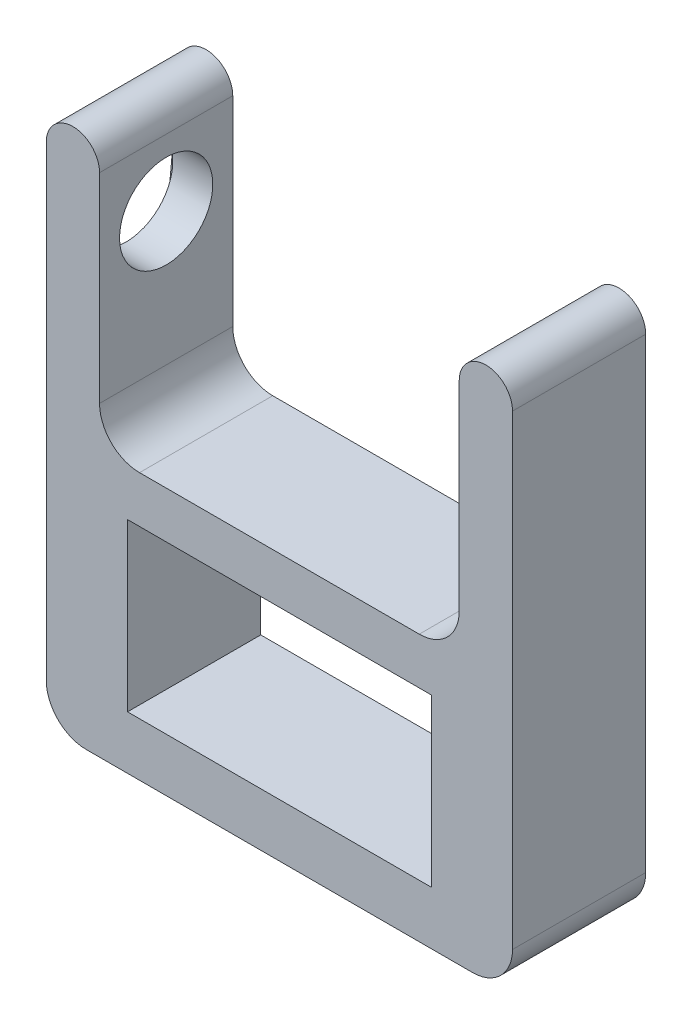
ISO-10303-21;
HEADER;
FILE_DESCRIPTION(('STEP AP214'),'2;1');
FILE_NAME('part.step','',(''),(''),'','','');
FILE_SCHEMA(('AUTOMOTIVE_DESIGN { 1 0 10303 214 1 1 1 1 }'));
ENDSEC;
DATA;
#1=APPLICATION_CONTEXT('core data for automotive mechanical design processes');
#2=APPLICATION_PROTOCOL_DEFINITION('international standard','automotive_design',2000,#1);
#3=PRODUCT_CONTEXT('',#1,'mechanical');
#4=PRODUCT('Part','Part','',(#3));
#5=PRODUCT_RELATED_PRODUCT_CATEGORY('part','',(#4));
#6=PRODUCT_DEFINITION_FORMATION('','',#4);
#7=PRODUCT_DEFINITION_CONTEXT('part definition',#1,'design');
#8=PRODUCT_DEFINITION('design','',#6,#7);
#9=PRODUCT_DEFINITION_SHAPE('','',#8);
#10=(LENGTH_UNIT() NAMED_UNIT(*) SI_UNIT(.MILLI.,.METRE.));
#11=(NAMED_UNIT(*) PLANE_ANGLE_UNIT() SI_UNIT($,.RADIAN.));
#12=(NAMED_UNIT(*) SI_UNIT($,.STERADIAN.) SOLID_ANGLE_UNIT());
#13=UNCERTAINTY_MEASURE_WITH_UNIT(LENGTH_MEASURE(1.E-05),#10,'distance_accuracy_value','');
#14=(GEOMETRIC_REPRESENTATION_CONTEXT(3) GLOBAL_UNCERTAINTY_ASSIGNED_CONTEXT((#13)) GLOBAL_UNIT_ASSIGNED_CONTEXT((#10,
#11,#12)) REPRESENTATION_CONTEXT('',''));
#15=CARTESIAN_POINT('',(0.,0.,0.));
#16=DIRECTION('',(0.,0.,1.));
#17=DIRECTION('',(1.,0.,0.));
#18=AXIS2_PLACEMENT_3D('',#15,#16,#17);
#19=CARTESIAN_POINT('',(17.501,13.,5.));
#20=DIRECTION('',(-1.,0.,0.));
#21=DIRECTION('',(0.,0.,1.));
#22=AXIS2_PLACEMENT_3D('',#19,#20,#21);
#23=CYLINDRICAL_SURFACE('',#22,3.5);
#24=CARTESIAN_POINT('',(-13.5,13.,5.));
#25=DIRECTION('',(-1.,0.,0.));
#26=DIRECTION('',(0.,0.,1.));
#27=AXIS2_PLACEMENT_3D('',#24,#25,#26);
#28=CIRCLE('',#27,3.5);
#29=CARTESIAN_POINT('',(-13.5,13.,8.5));
#30=VERTEX_POINT('',#29);
#31=EDGE_CURVE('E216',#30,#30,#28,.F.);
#32=ORIENTED_EDGE('',*,*,#31,.T.);
#33=EDGE_LOOP('',(#32));
#34=FACE_BOUND('',#33,.T.);
#35=CARTESIAN_POINT('',(-16.5,13.,5.));
#36=DIRECTION('',(-1.,0.,0.));
#37=DIRECTION('',(0.,0.,1.));
#38=AXIS2_PLACEMENT_3D('',#35,#36,#37);
#39=CIRCLE('',#38,3.5);
#40=CARTESIAN_POINT('',(-16.5,13.,8.5));
#41=VERTEX_POINT('',#40);
#42=EDGE_CURVE('E44',#41,#41,#39,.F.);
#43=ORIENTED_EDGE('',*,*,#42,.F.);
#44=EDGE_LOOP('',(#43));
#45=FACE_BOUND('',#44,.T.);
#46=ADVANCED_FACE('F40',(#34,#45),#23,.F.);
#47=CARTESIAN_POINT('',(15.5,18.,0.));
#48=DIRECTION('',(0.,0.,-1.));
#49=DIRECTION('',(-1.,0.,0.));
#50=AXIS2_PLACEMENT_3D('',#47,#48,#49);
#51=CYLINDRICAL_SURFACE('',#50,2.);
#52=DIRECTION('',(0.,0.,-1.));
#53=VECTOR('',#52,1.);
#54=CARTESIAN_POINT('',(17.5,18.,10.));
#55=LINE('',#54,#53);
#56=CARTESIAN_POINT('',(17.5,18.,0.));
#57=VERTEX_POINT('',#56);
#58=CARTESIAN_POINT('',(17.5,18.,10.));
#59=VERTEX_POINT('',#58);
#60=EDGE_CURVE('E312',#57,#59,#55,.F.);
#61=ORIENTED_EDGE('',*,*,#60,.F.);
#62=CARTESIAN_POINT('',(15.5,18.,0.));
#63=DIRECTION('',(0.,0.,-1.));
#64=DIRECTION('',(-1.,0.,0.));
#65=AXIS2_PLACEMENT_3D('',#62,#63,#64);
#66=CIRCLE('',#65,2.);
#67=CARTESIAN_POINT('',(13.5,18.,0.));
#68=VERTEX_POINT('',#67);
#69=EDGE_CURVE('E318',#68,#57,#66,.T.);
#70=ORIENTED_EDGE('',*,*,#69,.F.);
#71=DIRECTION('',(0.,0.,-1.));
#72=VECTOR('',#71,1.);
#73=CARTESIAN_POINT('',(13.5,18.,0.));
#74=LINE('',#73,#72);
#75=CARTESIAN_POINT('',(13.5,18.,10.));
#76=VERTEX_POINT('',#75);
#77=EDGE_CURVE('E315',#76,#68,#74,.T.);
#78=ORIENTED_EDGE('',*,*,#77,.F.);
#79=CARTESIAN_POINT('',(15.5,18.,10.));
#80=DIRECTION('',(0.,0.,-1.));
#81=DIRECTION('',(-1.,0.,0.));
#82=AXIS2_PLACEMENT_3D('',#79,#80,#81);
#83=CIRCLE('',#82,2.);
#84=EDGE_CURVE('E320',#59,#76,#83,.F.);
#85=ORIENTED_EDGE('',*,*,#84,.F.);
#86=EDGE_LOOP('',(#61,#70,#78,#85));
#87=FACE_BOUND('',#86,.T.);
#88=ADVANCED_FACE('F389',(#87),#51,.T.);
#89=CARTESIAN_POINT('',(-15.5,18.,10.));
#90=DIRECTION('',(0.,0.,-1.));
#91=DIRECTION('',(-1.,0.,0.));
#92=AXIS2_PLACEMENT_3D('',#89,#90,#91);
#93=CYLINDRICAL_SURFACE('',#92,2.);
#94=DIRECTION('',(0.,0.,-1.));
#95=VECTOR('',#94,1.);
#96=CARTESIAN_POINT('',(-17.5,18.,10.));
#97=LINE('',#96,#95);
#98=CARTESIAN_POINT('',(-17.5,18.,10.));
#99=VERTEX_POINT('',#98);
#100=CARTESIAN_POINT('',(-17.5,18.,0.));
#101=VERTEX_POINT('',#100);
#102=EDGE_CURVE('E302',#99,#101,#97,.T.);
#103=ORIENTED_EDGE('',*,*,#102,.F.);
#104=CARTESIAN_POINT('',(-15.5,18.,10.));
#105=DIRECTION('',(0.,0.,-1.));
#106=DIRECTION('',(-1.,0.,0.));
#107=AXIS2_PLACEMENT_3D('',#104,#105,#106);
#108=CIRCLE('',#107,2.);
#109=CARTESIAN_POINT('',(-13.5,18.,10.));
#110=VERTEX_POINT('',#109);
#111=EDGE_CURVE('E308',#110,#99,#108,.F.);
#112=ORIENTED_EDGE('',*,*,#111,.F.);
#113=DIRECTION('',(0.,0.,-1.));
#114=VECTOR('',#113,1.);
#115=CARTESIAN_POINT('',(-13.5,18.,0.));
#116=LINE('',#115,#114);
#117=CARTESIAN_POINT('',(-13.5,18.,0.));
#118=VERTEX_POINT('',#117);
#119=EDGE_CURVE('E305',#118,#110,#116,.F.);
#120=ORIENTED_EDGE('',*,*,#119,.F.);
#121=CARTESIAN_POINT('',(-15.5,18.,0.));
#122=DIRECTION('',(0.,0.,-1.));
#123=DIRECTION('',(-1.,0.,0.));
#124=AXIS2_PLACEMENT_3D('',#121,#122,#123);
#125=CIRCLE('',#124,2.);
#126=EDGE_CURVE('E310',#101,#118,#125,.T.);
#127=ORIENTED_EDGE('',*,*,#126,.F.);
#128=EDGE_LOOP('',(#103,#112,#120,#127));
#129=FACE_BOUND('',#128,.T.);
#130=ADVANCED_FACE('F365',(#129),#93,.T.);
#131=CARTESIAN_POINT('',(17.5,-20.,10.));
#132=DIRECTION('',(-1.,0.,0.));
#133=DIRECTION('',(0.,0.,1.));
#134=AXIS2_PLACEMENT_3D('',#131,#132,#133);
#135=PLANE('',#134);
#136=DIRECTION('',(0.,1.,0.));
#137=VECTOR('',#136,1.);
#138=CARTESIAN_POINT('',(17.5,-20.,0.));
#139=LINE('',#138,#137);
#140=CARTESIAN_POINT('',(17.5,-17.,0.));
#141=VERTEX_POINT('',#140);
#142=EDGE_CURVE('E261',#141,#57,#139,.T.);
#143=ORIENTED_EDGE('',*,*,#142,.T.);
#144=ORIENTED_EDGE('',*,*,#60,.T.);
#145=DIRECTION('',(0.,1.,0.));
#146=VECTOR('',#145,1.);
#147=CARTESIAN_POINT('',(17.5,-20.,10.));
#148=LINE('',#147,#146);
#149=CARTESIAN_POINT('',(17.5,-17.,10.));
#150=VERTEX_POINT('',#149);
#151=EDGE_CURVE('E267',#150,#59,#148,.T.);
#152=ORIENTED_EDGE('',*,*,#151,.F.);
#153=DIRECTION('',(0.,0.,-1.));
#154=VECTOR('',#153,1.);
#155=CARTESIAN_POINT('',(17.5,-17.,10.));
#156=LINE('',#155,#154);
#157=EDGE_CURVE('E276',#150,#141,#156,.T.);
#158=ORIENTED_EDGE('',*,*,#157,.T.);
#159=EDGE_LOOP('',(#143,#144,#152,#158));
#160=FACE_BOUND('',#159,.T.);
#161=ADVANCED_FACE('F385',(#160),#135,.F.);
#162=CARTESIAN_POINT('',(-17.5,-20.,10.));
#163=DIRECTION('',(1.,0.,0.));
#164=DIRECTION('',(0.,0.,-1.));
#165=AXIS2_PLACEMENT_3D('',#162,#163,#164);
#166=PLANE('',#165);
#167=DIRECTION('',(0.,-0.995037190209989,0.0995037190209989));
#168=VECTOR('',#167,1.);
#169=CARTESIAN_POINT('',(-17.5,13.,0.5));
#170=LINE('',#169,#168);
#171=CARTESIAN_POINT('',(-17.5,13.,0.499999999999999));
#172=VERTEX_POINT('',#171);
#173=CARTESIAN_POINT('',(-17.5,-2.,2.));
#174=VERTEX_POINT('',#173);
#175=EDGE_CURVE('E207',#172,#174,#170,.T.);
#176=ORIENTED_EDGE('',*,*,#175,.F.);
#177=CARTESIAN_POINT('',(-17.5,13.,5.));
#178=DIRECTION('',(-1.,0.,0.));
#179=DIRECTION('',(0.,0.,1.));
#180=AXIS2_PLACEMENT_3D('',#177,#178,#179);
#181=CIRCLE('',#180,4.5);
#182=CARTESIAN_POINT('',(-17.5,13.,9.5));
#183=VERTEX_POINT('',#182);
#184=EDGE_CURVE('E56',#183,#172,#181,.T.);
#185=ORIENTED_EDGE('',*,*,#184,.F.);
#186=DIRECTION('',(0.,0.995037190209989,0.099503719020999));
#187=VECTOR('',#186,1.);
#188=CARTESIAN_POINT('',(-17.5,13.,9.5));
#189=LINE('',#188,#187);
#190=CARTESIAN_POINT('',(-17.5,-2.,8.));
#191=VERTEX_POINT('',#190);
#192=EDGE_CURVE('E198',#191,#183,#189,.T.);
#193=ORIENTED_EDGE('',*,*,#192,.F.);
#194=CARTESIAN_POINT('',(-17.5,-2.,5.));
#195=DIRECTION('',(-1.,0.,0.));
#196=DIRECTION('',(0.,0.,1.));
#197=AXIS2_PLACEMENT_3D('',#194,#195,#196);
#198=CIRCLE('',#197,3.);
#199=EDGE_CURVE('E201',#174,#191,#198,.T.);
#200=ORIENTED_EDGE('',*,*,#199,.F.);
#201=EDGE_LOOP('',(#176,#185,#193,#200));
#202=FACE_BOUND('',#201,.T.);
#203=DIRECTION('',(0.,-1.,0.));
#204=VECTOR('',#203,1.);
#205=CARTESIAN_POINT('',(-17.5,-20.,10.));
#206=LINE('',#205,#204);
#207=CARTESIAN_POINT('',(-17.5,-17.,10.));
#208=VERTEX_POINT('',#207);
#209=EDGE_CURVE('E270',#99,#208,#206,.T.);
#210=ORIENTED_EDGE('',*,*,#209,.F.);
#211=ORIENTED_EDGE('',*,*,#102,.T.);
#212=DIRECTION('',(0.,-1.,0.));
#213=VECTOR('',#212,1.);
#214=CARTESIAN_POINT('',(-17.5,-20.,0.));
#215=LINE('',#214,#213);
#216=CARTESIAN_POINT('',(-17.5,-17.,0.));
#217=VERTEX_POINT('',#216);
#218=EDGE_CURVE('E279',#101,#217,#215,.T.);
#219=ORIENTED_EDGE('',*,*,#218,.T.);
#220=DIRECTION('',(0.,0.,-1.));
#221=VECTOR('',#220,1.);
#222=CARTESIAN_POINT('',(-17.5,-17.,10.));
#223=LINE('',#222,#221);
#224=EDGE_CURVE('E299',#217,#208,#223,.F.);
#225=ORIENTED_EDGE('',*,*,#224,.T.);
#226=EDGE_LOOP('',(#210,#211,#219,#225));
#227=FACE_BOUND('',#226,.T.);
#228=ADVANCED_FACE('F368',(#202,#227),#166,.F.);
#229=CARTESIAN_POINT('',(-17.5,-20.,10.));
#230=DIRECTION('',(0.,1.,0.));
#231=DIRECTION('',(0.,0.,1.));
#232=AXIS2_PLACEMENT_3D('',#229,#230,#231);
#233=PLANE('',#232);
#234=DIRECTION('',(1.,0.,0.));
#235=VECTOR('',#234,1.);
#236=CARTESIAN_POINT('',(-17.5,-20.,0.));
#237=LINE('',#236,#235);
#238=CARTESIAN_POINT('',(-14.5,-20.,0.));
#239=VERTEX_POINT('',#238);
#240=CARTESIAN_POINT('',(14.5,-20.,0.));
#241=VERTEX_POINT('',#240);
#242=EDGE_CURVE('E271',#239,#241,#237,.T.);
#243=ORIENTED_EDGE('',*,*,#242,.T.);
#244=DIRECTION('',(0.,0.,-1.));
#245=VECTOR('',#244,1.);
#246=CARTESIAN_POINT('',(14.5,-20.,10.));
#247=LINE('',#246,#245);
#248=CARTESIAN_POINT('',(14.5,-20.,10.));
#249=VERTEX_POINT('',#248);
#250=EDGE_CURVE('E293',#241,#249,#247,.F.);
#251=ORIENTED_EDGE('',*,*,#250,.T.);
#252=DIRECTION('',(1.,0.,0.));
#253=VECTOR('',#252,1.);
#254=CARTESIAN_POINT('',(-17.5,-20.,10.));
#255=LINE('',#254,#253);
#256=CARTESIAN_POINT('',(-14.5,-20.,10.));
#257=VERTEX_POINT('',#256);
#258=EDGE_CURVE('E273',#257,#249,#255,.T.);
#259=ORIENTED_EDGE('',*,*,#258,.F.);
#260=DIRECTION('',(0.,0.,-1.));
#261=VECTOR('',#260,1.);
#262=CARTESIAN_POINT('',(-14.5,-20.,10.));
#263=LINE('',#262,#261);
#264=EDGE_CURVE('E290',#257,#239,#263,.T.);
#265=ORIENTED_EDGE('',*,*,#264,.T.);
#266=EDGE_LOOP('',(#243,#251,#259,#265));
#267=FACE_BOUND('',#266,.T.);
#268=ADVANCED_FACE('F377',(#267),#233,.F.);
#269=CARTESIAN_POINT('',(0.,0.,10.));
#270=DIRECTION('',(0.,0.,-1.));
#271=DIRECTION('',(-1.,0.,0.));
#272=AXIS2_PLACEMENT_3D('',#269,#270,#271);
#273=PLANE('',#272);
#274=DIRECTION('',(1.,0.,0.));
#275=VECTOR('',#274,1.);
#276=CARTESIAN_POINT('',(-11.4,-16.,10.));
#277=LINE('',#276,#275);
#278=CARTESIAN_POINT('',(-11.4,-16.,10.));
#279=VERTEX_POINT('',#278);
#280=CARTESIAN_POINT('',(11.4,-16.,10.));
#281=VERTEX_POINT('',#280);
#282=EDGE_CURVE('E235',#279,#281,#277,.T.);
#283=ORIENTED_EDGE('',*,*,#282,.F.);
#284=DIRECTION('',(0.,-1.,0.));
#285=VECTOR('',#284,1.);
#286=CARTESIAN_POINT('',(-11.4,-16.,10.));
#287=LINE('',#286,#285);
#288=CARTESIAN_POINT('',(-11.4,-3.5,10.));
#289=VERTEX_POINT('',#288);
#290=EDGE_CURVE('E219',#289,#279,#287,.T.);
#291=ORIENTED_EDGE('',*,*,#290,.F.);
#292=DIRECTION('',(-1.,0.,0.));
#293=VECTOR('',#292,1.);
#294=CARTESIAN_POINT('',(-11.4,-3.5,10.));
#295=LINE('',#294,#293);
#296=CARTESIAN_POINT('',(11.4,-3.5,10.));
#297=VERTEX_POINT('',#296);
#298=EDGE_CURVE('E224',#297,#289,#295,.T.);
#299=ORIENTED_EDGE('',*,*,#298,.F.);
#300=DIRECTION('',(0.,1.,0.));
#301=VECTOR('',#300,1.);
#302=CARTESIAN_POINT('',(11.4,-16.,10.));
#303=LINE('',#302,#301);
#304=EDGE_CURVE('E238',#281,#297,#303,.T.);
#305=ORIENTED_EDGE('',*,*,#304,.F.);
#306=EDGE_LOOP('',(#283,#291,#299,#305));
#307=FACE_BOUND('',#306,.T.);
#308=ORIENTED_EDGE('',*,*,#151,.T.);
#309=ORIENTED_EDGE('',*,*,#84,.T.);
#310=DIRECTION('',(0.,1.,0.));
#311=VECTOR('',#310,1.);
#312=CARTESIAN_POINT('',(13.5,20.,10.));
#313=LINE('',#312,#311);
#314=CARTESIAN_POINT('',(13.5,3.,10.));
#315=VERTEX_POINT('',#314);
#316=EDGE_CURVE('E256',#315,#76,#313,.T.);
#317=ORIENTED_EDGE('',*,*,#316,.F.);
#318=CARTESIAN_POINT('',(10.5,3.,10.));
#319=DIRECTION('',(0.,0.,-1.));
#320=DIRECTION('',(-1.,0.,0.));
#321=AXIS2_PLACEMENT_3D('',#318,#319,#320);
#322=CIRCLE('',#321,3.);
#323=CARTESIAN_POINT('',(10.5,0.,10.));
#324=VERTEX_POINT('',#323);
#325=EDGE_CURVE('E333',#315,#324,#322,.T.);
#326=ORIENTED_EDGE('',*,*,#325,.T.);
#327=DIRECTION('',(1.,0.,0.));
#328=VECTOR('',#327,1.);
#329=CARTESIAN_POINT('',(-13.5,0.,10.));
#330=LINE('',#329,#328);
#331=CARTESIAN_POINT('',(-10.5,0.,10.));
#332=VERTEX_POINT('',#331);
#333=EDGE_CURVE('E263',#332,#324,#330,.T.);
#334=ORIENTED_EDGE('',*,*,#333,.F.);
#335=CARTESIAN_POINT('',(-10.5,3.,10.));
#336=DIRECTION('',(0.,0.,-1.));
#337=DIRECTION('',(-1.,0.,0.));
#338=AXIS2_PLACEMENT_3D('',#335,#336,#337);
#339=CIRCLE('',#338,3.);
#340=CARTESIAN_POINT('',(-13.5,3.,10.));
#341=VERTEX_POINT('',#340);
#342=EDGE_CURVE('E49',#332,#341,#339,.T.);
#343=ORIENTED_EDGE('',*,*,#342,.T.);
#344=DIRECTION('',(0.,-1.,0.));
#345=VECTOR('',#344,1.);
#346=CARTESIAN_POINT('',(-13.5,20.,10.));
#347=LINE('',#346,#345);
#348=EDGE_CURVE('E245',#110,#341,#347,.T.);
#349=ORIENTED_EDGE('',*,*,#348,.F.);
#350=ORIENTED_EDGE('',*,*,#111,.T.);
#351=ORIENTED_EDGE('',*,*,#209,.T.);
#352=CARTESIAN_POINT('',(-14.5,-17.,10.));
#353=DIRECTION('',(0.,0.,-1.));
#354=DIRECTION('',(-1.,0.,0.));
#355=AXIS2_PLACEMENT_3D('',#352,#353,#354);
#356=CIRCLE('',#355,3.);
#357=EDGE_CURVE('E295',#208,#257,#356,.F.);
#358=ORIENTED_EDGE('',*,*,#357,.T.);
#359=ORIENTED_EDGE('',*,*,#258,.T.);
#360=CARTESIAN_POINT('',(14.5,-17.,10.));
#361=DIRECTION('',(0.,0.,-1.));
#362=DIRECTION('',(-1.,0.,0.));
#363=AXIS2_PLACEMENT_3D('',#360,#361,#362);
#364=CIRCLE('',#363,3.);
#365=EDGE_CURVE('E297',#249,#150,#364,.F.);
#366=ORIENTED_EDGE('',*,*,#365,.T.);
#367=EDGE_LOOP('',(#308,#309,#317,#326,#334,#343,#349,#350,#351,#358,#359,#366));
#368=FACE_BOUND('',#367,.T.);
#369=ADVANCED_FACE('F351',(#307,#368),#273,.F.);
#370=CARTESIAN_POINT('',(0.,0.,0.));
#371=DIRECTION('',(0.,0.,-1.));
#372=DIRECTION('',(-1.,0.,0.));
#373=AXIS2_PLACEMENT_3D('',#370,#371,#372);
#374=PLANE('',#373);
#375=DIRECTION('',(0.,-1.,0.));
#376=VECTOR('',#375,1.);
#377=CARTESIAN_POINT('',(-11.4,-16.,0.));
#378=LINE('',#377,#376);
#379=CARTESIAN_POINT('',(-11.4,-3.5,0.));
#380=VERTEX_POINT('',#379);
#381=CARTESIAN_POINT('',(-11.4,-16.,0.));
#382=VERTEX_POINT('',#381);
#383=EDGE_CURVE('E220',#380,#382,#378,.T.);
#384=ORIENTED_EDGE('',*,*,#383,.T.);
#385=DIRECTION('',(1.,0.,0.));
#386=VECTOR('',#385,1.);
#387=CARTESIAN_POINT('',(-11.4,-16.,0.));
#388=LINE('',#387,#386);
#389=CARTESIAN_POINT('',(11.4,-16.,0.));
#390=VERTEX_POINT('',#389);
#391=EDGE_CURVE('E223',#382,#390,#388,.T.);
#392=ORIENTED_EDGE('',*,*,#391,.T.);
#393=DIRECTION('',(0.,1.,0.));
#394=VECTOR('',#393,1.);
#395=CARTESIAN_POINT('',(11.4,-16.,0.));
#396=LINE('',#395,#394);
#397=CARTESIAN_POINT('',(11.4,-3.5,0.));
#398=VERTEX_POINT('',#397);
#399=EDGE_CURVE('E227',#390,#398,#396,.T.);
#400=ORIENTED_EDGE('',*,*,#399,.T.);
#401=DIRECTION('',(-1.,0.,0.));
#402=VECTOR('',#401,1.);
#403=CARTESIAN_POINT('',(-11.4,-3.5,0.));
#404=LINE('',#403,#402);
#405=EDGE_CURVE('E230',#398,#380,#404,.T.);
#406=ORIENTED_EDGE('',*,*,#405,.T.);
#407=EDGE_LOOP('',(#384,#392,#400,#406));
#408=FACE_BOUND('',#407,.T.);
#409=DIRECTION('',(1.,0.,0.));
#410=VECTOR('',#409,1.);
#411=CARTESIAN_POINT('',(-13.5,0.,0.));
#412=LINE('',#411,#410);
#413=CARTESIAN_POINT('',(-10.5,0.,0.));
#414=VERTEX_POINT('',#413);
#415=CARTESIAN_POINT('',(10.5,0.,0.));
#416=VERTEX_POINT('',#415);
#417=EDGE_CURVE('E255',#414,#416,#412,.T.);
#418=ORIENTED_EDGE('',*,*,#417,.T.);
#419=CARTESIAN_POINT('',(10.5,3.,0.));
#420=DIRECTION('',(0.,0.,-1.));
#421=DIRECTION('',(-1.,0.,0.));
#422=AXIS2_PLACEMENT_3D('',#419,#420,#421);
#423=CIRCLE('',#422,3.);
#424=CARTESIAN_POINT('',(13.5,3.,0.));
#425=VERTEX_POINT('',#424);
#426=EDGE_CURVE('E335',#416,#425,#423,.F.);
#427=ORIENTED_EDGE('',*,*,#426,.T.);
#428=DIRECTION('',(0.,1.,0.));
#429=VECTOR('',#428,1.);
#430=CARTESIAN_POINT('',(13.5,20.,0.));
#431=LINE('',#430,#429);
#432=EDGE_CURVE('E259',#425,#68,#431,.T.);
#433=ORIENTED_EDGE('',*,*,#432,.T.);
#434=ORIENTED_EDGE('',*,*,#69,.T.);
#435=ORIENTED_EDGE('',*,*,#142,.F.);
#436=CARTESIAN_POINT('',(14.5,-17.,0.));
#437=DIRECTION('',(0.,0.,-1.));
#438=DIRECTION('',(-1.,0.,0.));
#439=AXIS2_PLACEMENT_3D('',#436,#437,#438);
#440=CIRCLE('',#439,3.);
#441=EDGE_CURVE('E288',#141,#241,#440,.T.);
#442=ORIENTED_EDGE('',*,*,#441,.T.);
#443=ORIENTED_EDGE('',*,*,#242,.F.);
#444=CARTESIAN_POINT('',(-14.5,-17.,0.));
#445=DIRECTION('',(0.,0.,-1.));
#446=DIRECTION('',(-1.,0.,0.));
#447=AXIS2_PLACEMENT_3D('',#444,#445,#446);
#448=CIRCLE('',#447,3.);
#449=EDGE_CURVE('E285',#239,#217,#448,.T.);
#450=ORIENTED_EDGE('',*,*,#449,.T.);
#451=ORIENTED_EDGE('',*,*,#218,.F.);
#452=ORIENTED_EDGE('',*,*,#126,.T.);
#453=DIRECTION('',(0.,-1.,0.));
#454=VECTOR('',#453,1.);
#455=CARTESIAN_POINT('',(-13.5,20.,0.));
#456=LINE('',#455,#454);
#457=CARTESIAN_POINT('',(-13.5,3.,0.));
#458=VERTEX_POINT('',#457);
#459=EDGE_CURVE('E252',#118,#458,#456,.T.);
#460=ORIENTED_EDGE('',*,*,#459,.T.);
#461=CARTESIAN_POINT('',(-10.5,3.,0.));
#462=DIRECTION('',(0.,0.,-1.));
#463=DIRECTION('',(-1.,0.,0.));
#464=AXIS2_PLACEMENT_3D('',#461,#462,#463);
#465=CIRCLE('',#464,3.);
#466=EDGE_CURVE('E11',#458,#414,#465,.F.);
#467=ORIENTED_EDGE('',*,*,#466,.T.);
#468=EDGE_LOOP('',(#418,#427,#433,#434,#435,#442,#443,#450,#451,#452,#460,#467));
#469=FACE_BOUND('',#468,.T.);
#470=ADVANCED_FACE('F340',(#408,#469),#374,.T.);
#471=CARTESIAN_POINT('',(14.5,-17.,10.));
#472=DIRECTION('',(0.,0.,-1.));
#473=DIRECTION('',(-1.,0.,0.));
#474=AXIS2_PLACEMENT_3D('',#471,#472,#473);
#475=CYLINDRICAL_SURFACE('',#474,3.);
#476=ORIENTED_EDGE('',*,*,#365,.F.);
#477=ORIENTED_EDGE('',*,*,#250,.F.);
#478=ORIENTED_EDGE('',*,*,#441,.F.);
#479=ORIENTED_EDGE('',*,*,#157,.F.);
#480=EDGE_LOOP('',(#476,#477,#478,#479));
#481=FACE_BOUND('',#480,.T.);
#482=ADVANCED_FACE('F381',(#481),#475,.T.);
#483=CARTESIAN_POINT('',(-14.5,-17.,10.));
#484=DIRECTION('',(0.,0.,-1.));
#485=DIRECTION('',(-1.,0.,0.));
#486=AXIS2_PLACEMENT_3D('',#483,#484,#485);
#487=CYLINDRICAL_SURFACE('',#486,3.);
#488=ORIENTED_EDGE('',*,*,#357,.F.);
#489=ORIENTED_EDGE('',*,*,#224,.F.);
#490=ORIENTED_EDGE('',*,*,#449,.F.);
#491=ORIENTED_EDGE('',*,*,#264,.F.);
#492=EDGE_LOOP('',(#488,#489,#490,#491));
#493=FACE_BOUND('',#492,.T.);
#494=ADVANCED_FACE('F373',(#493),#487,.T.);
#495=CARTESIAN_POINT('',(-13.5,20.,0.));
#496=DIRECTION('',(-1.,0.,0.));
#497=DIRECTION('',(0.,0.,1.));
#498=AXIS2_PLACEMENT_3D('',#495,#496,#497);
#499=PLANE('',#498);
#500=ORIENTED_EDGE('',*,*,#31,.F.);
#501=EDGE_LOOP('',(#500));
#502=FACE_BOUND('',#501,.T.);
#503=ORIENTED_EDGE('',*,*,#348,.T.);
#504=DIRECTION('',(0.,0.,1.));
#505=VECTOR('',#504,1.);
#506=CARTESIAN_POINT('',(-13.5,3.,0.));
#507=LINE('',#506,#505);
#508=EDGE_CURVE('E331',#341,#458,#507,.F.);
#509=ORIENTED_EDGE('',*,*,#508,.T.);
#510=ORIENTED_EDGE('',*,*,#459,.F.);
#511=ORIENTED_EDGE('',*,*,#119,.T.);
#512=EDGE_LOOP('',(#503,#509,#510,#511));
#513=FACE_BOUND('',#512,.T.);
#514=ADVANCED_FACE('F360',(#502,#513),#499,.F.);
#515=CARTESIAN_POINT('',(13.5,20.,0.));
#516=DIRECTION('',(1.,0.,0.));
#517=DIRECTION('',(0.,0.,-1.));
#518=AXIS2_PLACEMENT_3D('',#515,#516,#517);
#519=PLANE('',#518);
#520=ORIENTED_EDGE('',*,*,#432,.F.);
#521=DIRECTION('',(0.,0.,1.));
#522=VECTOR('',#521,1.);
#523=CARTESIAN_POINT('',(13.5,3.,10.));
#524=LINE('',#523,#522);
#525=EDGE_CURVE('E323',#425,#315,#524,.T.);
#526=ORIENTED_EDGE('',*,*,#525,.T.);
#527=ORIENTED_EDGE('',*,*,#316,.T.);
#528=ORIENTED_EDGE('',*,*,#77,.T.);
#529=EDGE_LOOP('',(#520,#526,#527,#528));
#530=FACE_BOUND('',#529,.T.);
#531=ADVANCED_FACE('F347',(#530),#519,.F.);
#532=CARTESIAN_POINT('',(-13.5,0.,0.));
#533=DIRECTION('',(0.,-1.,0.));
#534=DIRECTION('',(0.,0.,-1.));
#535=AXIS2_PLACEMENT_3D('',#532,#533,#534);
#536=PLANE('',#535);
#537=ORIENTED_EDGE('',*,*,#333,.T.);
#538=DIRECTION('',(0.,0.,1.));
#539=VECTOR('',#538,1.);
#540=CARTESIAN_POINT('',(10.5,0.,0.));
#541=LINE('',#540,#539);
#542=EDGE_CURVE('E329',#324,#416,#541,.F.);
#543=ORIENTED_EDGE('',*,*,#542,.T.);
#544=ORIENTED_EDGE('',*,*,#417,.F.);
#545=DIRECTION('',(0.,0.,1.));
#546=VECTOR('',#545,1.);
#547=CARTESIAN_POINT('',(-10.5,0.,10.));
#548=LINE('',#547,#546);
#549=EDGE_CURVE('E326',#414,#332,#548,.T.);
#550=ORIENTED_EDGE('',*,*,#549,.T.);
#551=EDGE_LOOP('',(#537,#543,#544,#550));
#552=FACE_BOUND('',#551,.T.);
#553=ADVANCED_FACE('F353',(#552),#536,.F.);
#554=CARTESIAN_POINT('',(-11.4,-16.,0.));
#555=DIRECTION('',(-1.,0.,0.));
#556=DIRECTION('',(0.,0.,1.));
#557=AXIS2_PLACEMENT_3D('',#554,#555,#556);
#558=PLANE('',#557);
#559=ORIENTED_EDGE('',*,*,#290,.T.);
#560=DIRECTION('',(0.,0.,1.));
#561=VECTOR('',#560,1.);
#562=CARTESIAN_POINT('',(-11.4,-16.,0.));
#563=LINE('',#562,#561);
#564=EDGE_CURVE('E233',#382,#279,#563,.T.);
#565=ORIENTED_EDGE('',*,*,#564,.F.);
#566=ORIENTED_EDGE('',*,*,#383,.F.);
#567=DIRECTION('',(0.,0.,1.));
#568=VECTOR('',#567,1.);
#569=CARTESIAN_POINT('',(-11.4,-3.5,0.));
#570=LINE('',#569,#568);
#571=EDGE_CURVE('E243',#380,#289,#570,.T.);
#572=ORIENTED_EDGE('',*,*,#571,.T.);
#573=EDGE_LOOP('',(#559,#565,#566,#572));
#574=FACE_BOUND('',#573,.T.);
#575=ADVANCED_FACE('F421',(#574),#558,.F.);
#576=CARTESIAN_POINT('',(-11.4,-3.5,0.));
#577=DIRECTION('',(0.,1.,0.));
#578=DIRECTION('',(0.,0.,1.));
#579=AXIS2_PLACEMENT_3D('',#576,#577,#578);
#580=PLANE('',#579);
#581=ORIENTED_EDGE('',*,*,#298,.T.);
#582=ORIENTED_EDGE('',*,*,#571,.F.);
#583=ORIENTED_EDGE('',*,*,#405,.F.);
#584=DIRECTION('',(0.,0.,1.));
#585=VECTOR('',#584,1.);
#586=CARTESIAN_POINT('',(11.4,-3.5,0.));
#587=LINE('',#586,#585);
#588=EDGE_CURVE('E246',#398,#297,#587,.T.);
#589=ORIENTED_EDGE('',*,*,#588,.T.);
#590=EDGE_LOOP('',(#581,#582,#583,#589));
#591=FACE_BOUND('',#590,.T.);
#592=ADVANCED_FACE('F416',(#591),#580,.F.);
#593=CARTESIAN_POINT('',(11.4,-16.,0.));
#594=DIRECTION('',(1.,0.,0.));
#595=DIRECTION('',(0.,0.,-1.));
#596=AXIS2_PLACEMENT_3D('',#593,#594,#595);
#597=PLANE('',#596);
#598=ORIENTED_EDGE('',*,*,#304,.T.);
#599=ORIENTED_EDGE('',*,*,#588,.F.);
#600=ORIENTED_EDGE('',*,*,#399,.F.);
#601=DIRECTION('',(0.,0.,1.));
#602=VECTOR('',#601,1.);
#603=CARTESIAN_POINT('',(11.4,-16.,0.));
#604=LINE('',#603,#602);
#605=EDGE_CURVE('E248',#390,#281,#604,.T.);
#606=ORIENTED_EDGE('',*,*,#605,.T.);
#607=EDGE_LOOP('',(#598,#599,#600,#606));
#608=FACE_BOUND('',#607,.T.);
#609=ADVANCED_FACE('F410',(#608),#597,.F.);
#610=CARTESIAN_POINT('',(-11.4,-16.,0.));
#611=DIRECTION('',(0.,-1.,0.));
#612=DIRECTION('',(0.,0.,-1.));
#613=AXIS2_PLACEMENT_3D('',#610,#611,#612);
#614=PLANE('',#613);
#615=ORIENTED_EDGE('',*,*,#282,.T.);
#616=ORIENTED_EDGE('',*,*,#605,.F.);
#617=ORIENTED_EDGE('',*,*,#391,.F.);
#618=ORIENTED_EDGE('',*,*,#564,.T.);
#619=EDGE_LOOP('',(#615,#616,#617,#618));
#620=FACE_BOUND('',#619,.T.);
#621=ADVANCED_FACE('F405',(#620),#614,.F.);
#622=CARTESIAN_POINT('',(10.5,3.,0.));
#623=DIRECTION('',(0.,0.,-1.));
#624=DIRECTION('',(-1.,0.,0.));
#625=AXIS2_PLACEMENT_3D('',#622,#623,#624);
#626=CYLINDRICAL_SURFACE('',#625,3.);
#627=ORIENTED_EDGE('',*,*,#426,.F.);
#628=ORIENTED_EDGE('',*,*,#542,.F.);
#629=ORIENTED_EDGE('',*,*,#325,.F.);
#630=ORIENTED_EDGE('',*,*,#525,.F.);
#631=EDGE_LOOP('',(#627,#628,#629,#630));
#632=FACE_BOUND('',#631,.T.);
#633=ADVANCED_FACE('F350',(#632),#626,.F.);
#634=CARTESIAN_POINT('',(-10.5,3.,0.));
#635=DIRECTION('',(0.,0.,-1.));
#636=DIRECTION('',(-1.,0.,0.));
#637=AXIS2_PLACEMENT_3D('',#634,#635,#636);
#638=CYLINDRICAL_SURFACE('',#637,3.);
#639=ORIENTED_EDGE('',*,*,#466,.F.);
#640=ORIENTED_EDGE('',*,*,#508,.F.);
#641=ORIENTED_EDGE('',*,*,#342,.F.);
#642=ORIENTED_EDGE('',*,*,#549,.F.);
#643=EDGE_LOOP('',(#639,#640,#641,#642));
#644=FACE_BOUND('',#643,.T.);
#645=ADVANCED_FACE('F42',(#644),#638,.F.);
#646=CARTESIAN_POINT('',(-16.5,13.,5.));
#647=DIRECTION('',(-1.,0.,0.));
#648=DIRECTION('',(0.,0.,1.));
#649=AXIS2_PLACEMENT_3D('',#646,#647,#648);
#650=PLANE('',#649);
#651=CARTESIAN_POINT('',(-16.5,13.,5.));
#652=DIRECTION('',(-1.,0.,0.));
#653=DIRECTION('',(0.,0.,1.));
#654=AXIS2_PLACEMENT_3D('',#651,#652,#653);
#655=CIRCLE('',#654,4.5);
#656=CARTESIAN_POINT('',(-16.5,13.,9.5));
#657=VERTEX_POINT('',#656);
#658=CARTESIAN_POINT('',(-16.5,13.,0.5));
#659=VERTEX_POINT('',#658);
#660=EDGE_CURVE('E179',#657,#659,#655,.T.);
#661=ORIENTED_EDGE('',*,*,#660,.T.);
#662=DIRECTION('',(0.,-0.995037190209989,0.0995037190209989));
#663=VECTOR('',#662,1.);
#664=CARTESIAN_POINT('',(-16.5,13.,0.5));
#665=LINE('',#664,#663);
#666=CARTESIAN_POINT('',(-16.5,-2.,2.));
#667=VERTEX_POINT('',#666);
#668=EDGE_CURVE('E188',#659,#667,#665,.T.);
#669=ORIENTED_EDGE('',*,*,#668,.T.);
#670=CARTESIAN_POINT('',(-16.5,-2.,5.));
#671=DIRECTION('',(-1.,0.,0.));
#672=DIRECTION('',(0.,0.,1.));
#673=AXIS2_PLACEMENT_3D('',#670,#671,#672);
#674=CIRCLE('',#673,3.);
#675=CARTESIAN_POINT('',(-16.5,-2.,8.));
#676=VERTEX_POINT('',#675);
#677=EDGE_CURVE('E193',#667,#676,#674,.T.);
#678=ORIENTED_EDGE('',*,*,#677,.T.);
#679=DIRECTION('',(0.,0.995037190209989,0.099503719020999));
#680=VECTOR('',#679,1.);
#681=CARTESIAN_POINT('',(-16.5,13.,9.5));
#682=LINE('',#681,#680);
#683=EDGE_CURVE('E185',#676,#657,#682,.T.);
#684=ORIENTED_EDGE('',*,*,#683,.T.);
#685=EDGE_LOOP('',(#661,#669,#678,#684));
#686=FACE_BOUND('',#685,.T.);
#687=ORIENTED_EDGE('',*,*,#42,.T.);
#688=EDGE_LOOP('',(#687));
#689=FACE_BOUND('',#688,.T.);
#690=ADVANCED_FACE('F195',(#686,#689),#650,.T.);
#691=CARTESIAN_POINT('',(-16.5,13.,5.));
#692=DIRECTION('',(-1.,0.,0.));
#693=DIRECTION('',(0.,0.,1.));
#694=AXIS2_PLACEMENT_3D('',#691,#692,#693);
#695=CYLINDRICAL_SURFACE('',#694,4.5);
#696=ORIENTED_EDGE('',*,*,#184,.T.);
#697=DIRECTION('',(-1.,0.,0.));
#698=VECTOR('',#697,1.);
#699=CARTESIAN_POINT('',(-16.5,13.,0.5));
#700=LINE('',#699,#698);
#701=EDGE_CURVE('E175',#659,#172,#700,.T.);
#702=ORIENTED_EDGE('',*,*,#701,.F.);
#703=ORIENTED_EDGE('',*,*,#660,.F.);
#704=DIRECTION('',(-1.,0.,0.));
#705=VECTOR('',#704,1.);
#706=CARTESIAN_POINT('',(-16.5,13.,9.5));
#707=LINE('',#706,#705);
#708=EDGE_CURVE('E211',#657,#183,#707,.T.);
#709=ORIENTED_EDGE('',*,*,#708,.T.);
#710=EDGE_LOOP('',(#696,#702,#703,#709));
#711=FACE_BOUND('',#710,.T.);
#712=ADVANCED_FACE('F177',(#711),#695,.F.);
#713=CARTESIAN_POINT('',(-16.5,13.,9.5));
#714=DIRECTION('',(0.,-0.099503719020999,0.995037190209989));
#715=DIRECTION('',(0.,-0.995037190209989,-0.099503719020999));
#716=AXIS2_PLACEMENT_3D('',#713,#714,#715);
#717=PLANE('',#716);
#718=ORIENTED_EDGE('',*,*,#192,.T.);
#719=ORIENTED_EDGE('',*,*,#708,.F.);
#720=ORIENTED_EDGE('',*,*,#683,.F.);
#721=DIRECTION('',(-1.,0.,0.));
#722=VECTOR('',#721,1.);
#723=CARTESIAN_POINT('',(-16.5,-2.,8.));
#724=LINE('',#723,#722);
#725=EDGE_CURVE('E213',#676,#191,#724,.T.);
#726=ORIENTED_EDGE('',*,*,#725,.T.);
#727=EDGE_LOOP('',(#718,#719,#720,#726));
#728=FACE_BOUND('',#727,.T.);
#729=ADVANCED_FACE('F559',(#728),#717,.F.);
#730=CARTESIAN_POINT('',(-16.5,-2.,5.));
#731=DIRECTION('',(-1.,0.,0.));
#732=DIRECTION('',(0.,0.,1.));
#733=AXIS2_PLACEMENT_3D('',#730,#731,#732);
#734=CYLINDRICAL_SURFACE('',#733,3.);
#735=ORIENTED_EDGE('',*,*,#199,.T.);
#736=ORIENTED_EDGE('',*,*,#725,.F.);
#737=ORIENTED_EDGE('',*,*,#677,.F.);
#738=DIRECTION('',(-1.,0.,0.));
#739=VECTOR('',#738,1.);
#740=CARTESIAN_POINT('',(-16.5,-2.,2.));
#741=LINE('',#740,#739);
#742=EDGE_CURVE('E184',#667,#174,#741,.T.);
#743=ORIENTED_EDGE('',*,*,#742,.T.);
#744=EDGE_LOOP('',(#735,#736,#737,#743));
#745=FACE_BOUND('',#744,.T.);
#746=ADVANCED_FACE('F568',(#745),#734,.F.);
#747=CARTESIAN_POINT('',(-16.5,13.,0.5));
#748=DIRECTION('',(0.,-0.0995037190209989,-0.995037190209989));
#749=DIRECTION('',(0.,0.995037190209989,-0.0995037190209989));
#750=AXIS2_PLACEMENT_3D('',#747,#748,#749);
#751=PLANE('',#750);
#752=ORIENTED_EDGE('',*,*,#175,.T.);
#753=ORIENTED_EDGE('',*,*,#742,.F.);
#754=ORIENTED_EDGE('',*,*,#668,.F.);
#755=ORIENTED_EDGE('',*,*,#701,.T.);
#756=EDGE_LOOP('',(#752,#753,#754,#755));
#757=FACE_BOUND('',#756,.T.);
#758=ADVANCED_FACE('F189',(#757),#751,.F.);
#759=CLOSED_SHELL('',(#46,#88,#130,#161,#228,#268,#369,#470,#482,#494,#514,#531,#553,#575,#592,
#609,#621,#633,#645,#690,#712,#729,#746,#758));
#760=MANIFOLD_SOLID_BREP('B2',#759);
#761=ADVANCED_BREP_SHAPE_REPRESENTATION('',(#18,#760),#14);
#762=SHAPE_DEFINITION_REPRESENTATION(#9,#761);
ENDSEC;
END-ISO-10303-21;
